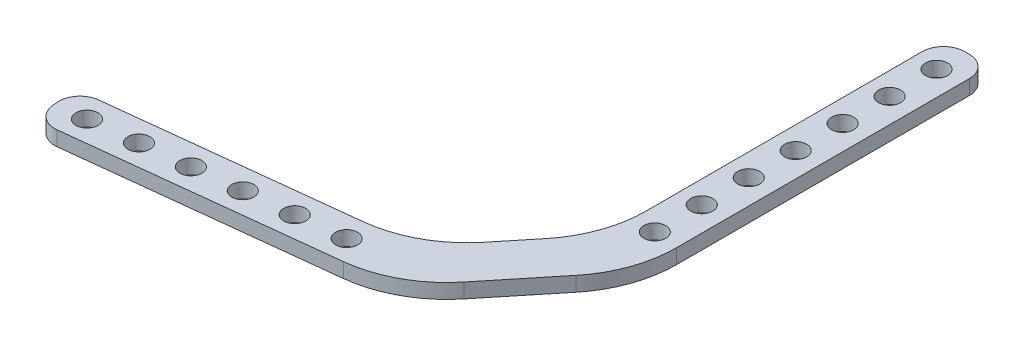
ISO-10303-21;
HEADER;
FILE_DESCRIPTION(('STEP AP214'),'2;1');
FILE_NAME('part.step','',(''),(''),'','','');
FILE_SCHEMA(('AUTOMOTIVE_DESIGN { 1 0 10303 214 1 1 1 1 }'));
ENDSEC;
DATA;
#1=APPLICATION_CONTEXT('core data for automotive mechanical design processes');
#2=APPLICATION_PROTOCOL_DEFINITION('international standard','automotive_design',2000,#1);
#3=PRODUCT_CONTEXT('',#1,'mechanical');
#4=PRODUCT('Part','Part','',(#3));
#5=PRODUCT_RELATED_PRODUCT_CATEGORY('part','',(#4));
#6=PRODUCT_DEFINITION_FORMATION('','',#4);
#7=PRODUCT_DEFINITION_CONTEXT('part definition',#1,'design');
#8=PRODUCT_DEFINITION('design','',#6,#7);
#9=PRODUCT_DEFINITION_SHAPE('','',#8);
#10=(LENGTH_UNIT() NAMED_UNIT(*) SI_UNIT(.MILLI.,.METRE.));
#11=(NAMED_UNIT(*) PLANE_ANGLE_UNIT() SI_UNIT($,.RADIAN.));
#12=(NAMED_UNIT(*) SI_UNIT($,.STERADIAN.) SOLID_ANGLE_UNIT());
#13=UNCERTAINTY_MEASURE_WITH_UNIT(LENGTH_MEASURE(1.E-05),#10,'distance_accuracy_value','');
#14=(GEOMETRIC_REPRESENTATION_CONTEXT(3) GLOBAL_UNCERTAINTY_ASSIGNED_CONTEXT((#13)) GLOBAL_UNIT_ASSIGNED_CONTEXT((#10,
#11,#12)) REPRESENTATION_CONTEXT('',''));
#15=CARTESIAN_POINT('',(0.,0.,0.));
#16=DIRECTION('',(0.,0.,1.));
#17=DIRECTION('',(1.,0.,0.));
#18=AXIS2_PLACEMENT_3D('',#15,#16,#17);
#19=CARTESIAN_POINT('',(-4.572,3.175,-72.37519815));
#20=DIRECTION('',(0.,1.,0.));
#21=DIRECTION('',(0.,0.,1.));
#22=AXIS2_PLACEMENT_3D('',#19,#20,#21);
#23=PLANE('',#22);
#24=CARTESIAN_POINT('',(-37.4021505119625,3.175,24.9485150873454));
#25=DIRECTION('',(0.,1.,0.));
#26=DIRECTION('',(0.,0.,1.));
#27=AXIS2_PLACEMENT_3D('',#24,#25,#26);
#28=CIRCLE('',#27,2.38125000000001);
#29=CARTESIAN_POINT('',(-37.4021505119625,3.175,27.3297650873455));
#30=VERTEX_POINT('',#29);
#31=EDGE_CURVE('E497',#30,#30,#28,.T.);
#32=ORIENTED_EDGE('',*,*,#31,.F.);
#33=EDGE_LOOP('',(#32));
#34=FACE_BOUND('',#33,.T.);
#35=CARTESIAN_POINT('',(-5.31034936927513,3.175,-29.95719815));
#36=DIRECTION('',(0.,1.,0.));
#37=DIRECTION('',(0.,0.,1.));
#38=AXIS2_PLACEMENT_3D('',#35,#36,#37);
#39=CIRCLE('',#38,2.38125);
#40=CARTESIAN_POINT('',(-5.31034936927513,3.175,-27.57594815));
#41=VERTEX_POINT('',#40);
#42=EDGE_CURVE('E505',#41,#41,#39,.T.);
#43=ORIENTED_EDGE('',*,*,#42,.F.);
#44=EDGE_LOOP('',(#43));
#45=FACE_BOUND('',#44,.T.);
#46=CARTESIAN_POINT('',(-5.31034936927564,3.175,-50.27719815));
#47=DIRECTION('',(0.,1.,0.));
#48=DIRECTION('',(0.,0.,1.));
#49=AXIS2_PLACEMENT_3D('',#46,#47,#48);
#50=CIRCLE('',#49,2.38125);
#51=CARTESIAN_POINT('',(-5.31034936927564,3.175,-47.89594815));
#52=VERTEX_POINT('',#51);
#53=EDGE_CURVE('E513',#52,#52,#50,.T.);
#54=ORIENTED_EDGE('',*,*,#53,.F.);
#55=EDGE_LOOP('',(#54));
#56=FACE_BOUND('',#55,.T.);
#57=CARTESIAN_POINT('',(-5.31034936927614,3.175,-70.59719815));
#58=DIRECTION('',(0.,1.,0.));
#59=DIRECTION('',(0.,0.,1.));
#60=AXIS2_PLACEMENT_3D('',#57,#58,#59);
#61=CIRCLE('',#60,2.38125);
#62=CARTESIAN_POINT('',(-5.31034936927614,3.175,-68.21594815));
#63=VERTEX_POINT('',#62);
#64=EDGE_CURVE('E521',#63,#63,#61,.T.);
#65=ORIENTED_EDGE('',*,*,#64,.F.);
#66=EDGE_LOOP('',(#65));
#67=FACE_BOUND('',#66,.T.);
#68=CARTESIAN_POINT('',(-57.593928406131,3.175,27.2276608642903));
#69=DIRECTION('',(0.,1.,0.));
#70=DIRECTION('',(0.,0.,1.));
#71=AXIS2_PLACEMENT_3D('',#68,#69,#70);
#72=CIRCLE('',#71,2.38124999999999);
#73=CARTESIAN_POINT('',(-57.593928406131,3.175,29.6089108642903));
#74=VERTEX_POINT('',#73);
#75=EDGE_CURVE('E529',#74,#74,#72,.T.);
#76=ORIENTED_EDGE('',*,*,#75,.F.);
#77=EDGE_LOOP('',(#76));
#78=FACE_BOUND('',#77,.T.);
#79=CARTESIAN_POINT('',(-77.7857063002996,3.175,29.5068066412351));
#80=DIRECTION('',(0.,1.,0.));
#81=DIRECTION('',(0.,0.,1.));
#82=AXIS2_PLACEMENT_3D('',#79,#80,#81);
#83=CIRCLE('',#82,2.38125000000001);
#84=CARTESIAN_POINT('',(-77.7857063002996,3.175,31.8880566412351));
#85=VERTEX_POINT('',#84);
#86=EDGE_CURVE('E431',#85,#85,#83,.T.);
#87=ORIENTED_EDGE('',*,*,#86,.F.);
#88=EDGE_LOOP('',(#87));
#89=FACE_BOUND('',#88,.T.);
#90=DIRECTION('',(0.630592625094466,0.,-0.776114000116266));
#91=VECTOR('',#90,1.);
#92=CARTESIAN_POINT('',(-23.114,3.175,28.448));
#93=LINE('',#92,#91);
#94=CARTESIAN_POINT('',(-16.5667748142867,3.175,20.3898766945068));
#95=VERTEX_POINT('',#94);
#96=CARTESIAN_POINT('',(-5.68670439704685,3.175,6.99902079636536));
#97=VERTEX_POINT('',#96);
#98=EDGE_CURVE('E159',#95,#97,#93,.T.);
#99=ORIENTED_EDGE('',*,*,#98,.T.);
#100=CARTESIAN_POINT('',(-25.4,3.175,-9.01803188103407));
#101=DIRECTION('',(0.,1.,0.));
#102=DIRECTION('',(0.,0.,1.));
#103=AXIS2_PLACEMENT_3D('',#100,#101,#102);
#104=CIRCLE('',#103,25.4);
#105=CARTESIAN_POINT('',(0.,3.175,-9.01803188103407));
#106=VERTEX_POINT('',#105);
#107=EDGE_CURVE('E155',#97,#106,#104,.T.);
#108=ORIENTED_EDGE('',*,*,#107,.T.);
#109=DIRECTION('',(0.,0.,-1.));
#110=VECTOR('',#109,1.);
#111=CARTESIAN_POINT('',(0.,3.175,0.));
#112=LINE('',#111,#110);
#113=CARTESIAN_POINT('',(0.,3.175,-72.37519815));
#114=VERTEX_POINT('',#113);
#115=EDGE_CURVE('E148',#106,#114,#112,.T.);
#116=ORIENTED_EDGE('',*,*,#115,.T.);
#117=CARTESIAN_POINT('',(-4.572,3.175,-72.37519815));
#118=DIRECTION('',(0.,1.,0.));
#119=DIRECTION('',(0.,0.,1.));
#120=AXIS2_PLACEMENT_3D('',#117,#118,#119);
#121=CIRCLE('',#120,4.572);
#122=CARTESIAN_POINT('',(-4.572,3.175,-76.94719815));
#123=VERTEX_POINT('',#122);
#124=EDGE_CURVE('E152',#114,#123,#121,.T.);
#125=ORIENTED_EDGE('',*,*,#124,.T.);
#126=DIRECTION('',(-1.,0.,0.));
#127=VECTOR('',#126,1.);
#128=CARTESIAN_POINT('',(-4.572,3.175,-76.94719815));
#129=LINE('',#128,#127);
#130=CARTESIAN_POINT('',(-5.588,3.175,-76.94719815));
#131=VERTEX_POINT('',#130);
#132=EDGE_CURVE('E174',#123,#131,#129,.T.);
#133=ORIENTED_EDGE('',*,*,#132,.T.);
#134=CARTESIAN_POINT('',(-5.588,3.175,-72.37519815));
#135=DIRECTION('',(0.,1.,0.));
#136=DIRECTION('',(0.,0.,1.));
#137=AXIS2_PLACEMENT_3D('',#134,#135,#136);
#138=CIRCLE('',#137,4.572);
#139=CARTESIAN_POINT('',(-10.16,3.175,-72.37519815));
#140=VERTEX_POINT('',#139);
#141=EDGE_CURVE('E176',#131,#140,#138,.T.);
#142=ORIENTED_EDGE('',*,*,#141,.T.);
#143=DIRECTION('',(0.,0.,1.));
#144=VECTOR('',#143,1.);
#145=CARTESIAN_POINT('',(-10.16,3.175,-72.37519815));
#146=LINE('',#145,#144);
#147=CARTESIAN_POINT('',(-10.16,3.175,-12.6252446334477));
#148=VERTEX_POINT('',#147);
#149=EDGE_CURVE('E181',#140,#148,#146,.T.);
#150=ORIENTED_EDGE('',*,*,#149,.T.);
#151=CARTESIAN_POINT('',(-35.56,3.175,-12.6252446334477));
#152=DIRECTION('',(0.,1.,0.));
#153=DIRECTION('',(0.,0.,1.));
#154=AXIS2_PLACEMENT_3D('',#151,#152,#153);
#155=CIRCLE('',#154,25.4);
#156=CARTESIAN_POINT('',(-15.8467043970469,3.175,3.39180804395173));
#157=VERTEX_POINT('',#156);
#158=EDGE_CURVE('E267',#148,#157,#155,.F.);
#159=ORIENTED_EDGE('',*,*,#158,.T.);
#160=DIRECTION('',(-0.630592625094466,0.,0.776114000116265));
#161=VECTOR('',#160,1.);
#162=CARTESIAN_POINT('',(-10.16,3.175,-3.60721275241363));
#163=LINE('',#162,#161);
#164=CARTESIAN_POINT('',(-21.8332029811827,3.175,10.7598063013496));
#165=VERTEX_POINT('',#164);
#166=EDGE_CURVE('E184',#157,#165,#163,.T.);
#167=ORIENTED_EDGE('',*,*,#166,.T.);
#168=CARTESIAN_POINT('',(-41.5464985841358,3.175,-5.2572463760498));
#169=DIRECTION('',(0.,1.,0.));
#170=DIRECTION('',(0.,0.,1.));
#171=AXIS2_PLACEMENT_3D('',#168,#169,#170);
#172=CIRCLE('',#171,25.4);
#173=CARTESIAN_POINT('',(-38.6975663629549,3.175,19.9824759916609));
#174=VERTEX_POINT('',#173);
#175=EDGE_CURVE('E11',#165,#174,#172,.F.);
#176=ORIENTED_EDGE('',*,*,#175,.T.);
#177=DIRECTION('',(-0.993689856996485,0.,0.112162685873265));
#178=VECTOR('',#177,1.);
#179=CARTESIAN_POINT('',(-28.3804281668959,3.175,18.8179296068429));
#180=LINE('',#179,#178);
#181=CARTESIAN_POINT('',(-90.2181622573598,3.175,25.797860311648));
#182=VERTEX_POINT('',#181);
#183=EDGE_CURVE('E187',#174,#182,#180,.T.);
#184=ORIENTED_EDGE('',*,*,#183,.T.);
#185=CARTESIAN_POINT('',(-89.7053544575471,3.175,30.3410103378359));
#186=DIRECTION('',(0.,1.,0.));
#187=DIRECTION('',(0.,0.,1.));
#188=AXIS2_PLACEMENT_3D('',#185,#186,#187);
#189=CIRCLE('',#188,4.57200000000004);
#190=CARTESIAN_POINT('',(-94.2485044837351,3.175,30.8538181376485));
#191=VERTEX_POINT('',#190);
#192=EDGE_CURVE('E189',#182,#191,#189,.T.);
#193=ORIENTED_EDGE('',*,*,#192,.T.);
#194=DIRECTION('',(0.112162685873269,0.,0.993689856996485));
#195=VECTOR('',#194,1.);
#196=CARTESIAN_POINT('',(-94.2485044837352,3.175,30.8538181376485));
#197=LINE('',#196,#195);
#198=CARTESIAN_POINT('',(-94.1345471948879,3.175,31.863407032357));
#199=VERTEX_POINT('',#198);
#200=EDGE_CURVE('E191',#191,#199,#197,.T.);
#201=ORIENTED_EDGE('',*,*,#200,.T.);
#202=CARTESIAN_POINT('',(-89.5913971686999,3.175,31.3505992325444));
#203=DIRECTION('',(0.,1.,0.));
#204=DIRECTION('',(0.,0.,1.));
#205=AXIS2_PLACEMENT_3D('',#202,#203,#204);
#206=CIRCLE('',#205,4.57200000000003);
#207=CARTESIAN_POINT('',(-89.0785893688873,3.175,35.8937492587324));
#208=VERTEX_POINT('',#207);
#209=EDGE_CURVE('E193',#199,#208,#206,.T.);
#210=ORIENTED_EDGE('',*,*,#209,.T.);
#211=DIRECTION('',(0.993689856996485,0.,-0.112162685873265));
#212=VECTOR('',#211,1.);
#213=CARTESIAN_POINT('',(-89.0785893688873,3.175,35.8937492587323));
#214=LINE('',#213,#212);
#215=CARTESIAN_POINT('',(-33.431138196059,3.175,29.6125463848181));
#216=VERTEX_POINT('',#215);
#217=EDGE_CURVE('E195',#208,#216,#214,.T.);
#218=ORIENTED_EDGE('',*,*,#217,.T.);
#219=CARTESIAN_POINT('',(-36.2800704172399,3.175,4.37282401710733));
#220=DIRECTION('',(0.,1.,0.));
#221=DIRECTION('',(0.,0.,1.));
#222=AXIS2_PLACEMENT_3D('',#219,#220,#221);
#223=CIRCLE('',#222,25.4);
#224=EDGE_CURVE('E261',#216,#95,#223,.T.);
#225=ORIENTED_EDGE('',*,*,#224,.T.);
#226=EDGE_LOOP('',(#99,#108,#116,#125,#133,#142,#150,#159,#167,#176,#184,#193,#201,#210,#218,#225));
#227=FACE_BOUND('',#226,.T.);
#228=CARTESIAN_POINT('',(-87.8815952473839,3.175,30.6463795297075));
#229=DIRECTION('',(0.,1.,0.));
#230=DIRECTION('',(0.,0.,1.));
#231=AXIS2_PLACEMENT_3D('',#228,#229,#230);
#232=CIRCLE('',#231,2.38124999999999);
#233=CARTESIAN_POINT('',(-87.8815952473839,3.175,33.0276295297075));
#234=VERTEX_POINT('',#233);
#235=EDGE_CURVE('E200',#234,#234,#232,.T.);
#236=ORIENTED_EDGE('',*,*,#235,.F.);
#237=EDGE_LOOP('',(#236));
#238=FACE_BOUND('',#237,.T.);
#239=CARTESIAN_POINT('',(-67.6898173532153,3.175,28.3672337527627));
#240=DIRECTION('',(0.,1.,0.));
#241=DIRECTION('',(0.,0.,1.));
#242=AXIS2_PLACEMENT_3D('',#239,#240,#241);
#243=CIRCLE('',#242,2.38124999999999);
#244=CARTESIAN_POINT('',(-67.6898173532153,3.175,30.7484837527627));
#245=VERTEX_POINT('',#244);
#246=EDGE_CURVE('E436',#245,#245,#243,.T.);
#247=ORIENTED_EDGE('',*,*,#246,.F.);
#248=EDGE_LOOP('',(#247));
#249=FACE_BOUND('',#248,.T.);
#250=CARTESIAN_POINT('',(-47.4980394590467,3.175,26.0880879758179));
#251=DIRECTION('',(0.,1.,0.));
#252=DIRECTION('',(0.,0.,1.));
#253=AXIS2_PLACEMENT_3D('',#250,#251,#252);
#254=CIRCLE('',#253,2.38125);
#255=CARTESIAN_POINT('',(-47.4980394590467,3.175,28.4693379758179));
#256=VERTEX_POINT('',#255);
#257=EDGE_CURVE('E525',#256,#256,#254,.T.);
#258=ORIENTED_EDGE('',*,*,#257,.F.);
#259=EDGE_LOOP('',(#258));
#260=FACE_BOUND('',#259,.T.);
#261=CARTESIAN_POINT('',(-5.31034936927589,3.175,-60.43719815));
#262=DIRECTION('',(0.,1.,0.));
#263=DIRECTION('',(0.,0.,1.));
#264=AXIS2_PLACEMENT_3D('',#261,#262,#263);
#265=CIRCLE('',#264,2.38125);
#266=CARTESIAN_POINT('',(-5.31034936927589,3.175,-58.05594815));
#267=VERTEX_POINT('',#266);
#268=EDGE_CURVE('E517',#267,#267,#265,.T.);
#269=ORIENTED_EDGE('',*,*,#268,.F.);
#270=EDGE_LOOP('',(#269));
#271=FACE_BOUND('',#270,.T.);
#272=CARTESIAN_POINT('',(-5.31034936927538,3.175,-40.11719815));
#273=DIRECTION('',(0.,1.,0.));
#274=DIRECTION('',(0.,0.,1.));
#275=AXIS2_PLACEMENT_3D('',#272,#273,#274);
#276=CIRCLE('',#275,2.38125);
#277=CARTESIAN_POINT('',(-5.31034936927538,3.175,-37.73594815));
#278=VERTEX_POINT('',#277);
#279=EDGE_CURVE('E509',#278,#278,#276,.T.);
#280=ORIENTED_EDGE('',*,*,#279,.F.);
#281=EDGE_LOOP('',(#280));
#282=FACE_BOUND('',#281,.T.);
#283=CARTESIAN_POINT('',(-5.31034936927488,3.175,-19.79719815));
#284=DIRECTION('',(0.,1.,0.));
#285=DIRECTION('',(0.,0.,1.));
#286=AXIS2_PLACEMENT_3D('',#283,#284,#285);
#287=CIRCLE('',#286,2.38125);
#288=CARTESIAN_POINT('',(-5.31034936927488,3.175,-17.41594815));
#289=VERTEX_POINT('',#288);
#290=EDGE_CURVE('E501',#289,#289,#287,.T.);
#291=ORIENTED_EDGE('',*,*,#290,.F.);
#292=EDGE_LOOP('',(#291));
#293=FACE_BOUND('',#292,.T.);
#294=CARTESIAN_POINT('',(-5.31034936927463,3.175,-9.63719815));
#295=DIRECTION('',(0.,1.,0.));
#296=DIRECTION('',(0.,0.,1.));
#297=AXIS2_PLACEMENT_3D('',#294,#295,#296);
#298=CIRCLE('',#297,2.38125);
#299=CARTESIAN_POINT('',(-5.31034936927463,3.175,-7.25594815));
#300=VERTEX_POINT('',#299);
#301=EDGE_CURVE('E493',#300,#300,#298,.T.);
#302=ORIENTED_EDGE('',*,*,#301,.F.);
#303=EDGE_LOOP('',(#302));
#304=FACE_BOUND('',#303,.T.);
#305=ADVANCED_FACE('F33',(#34,#45,#56,#67,#78,#89,#227,#238,#249,#260,#271,#282,#293,#304),#23,.T.);
#306=CARTESIAN_POINT('',(-4.572,0.,-72.37519815));
#307=DIRECTION('',(0.,1.,0.));
#308=DIRECTION('',(0.,0.,1.));
#309=AXIS2_PLACEMENT_3D('',#306,#307,#308);
#310=PLANE('',#309);
#311=DIRECTION('',(0.,0.,-1.));
#312=VECTOR('',#311,1.);
#313=CARTESIAN_POINT('',(0.,0.,0.));
#314=LINE('',#313,#312);
#315=CARTESIAN_POINT('',(0.,0.,-9.01803188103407));
#316=VERTEX_POINT('',#315);
#317=CARTESIAN_POINT('',(0.,0.,-72.37519815));
#318=VERTEX_POINT('',#317);
#319=EDGE_CURVE('E165',#316,#318,#314,.T.);
#320=ORIENTED_EDGE('',*,*,#319,.F.);
#321=CARTESIAN_POINT('',(-25.4,0.,-9.01803188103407));
#322=DIRECTION('',(0.,1.,0.));
#323=DIRECTION('',(0.,0.,1.));
#324=AXIS2_PLACEMENT_3D('',#321,#322,#323);
#325=CIRCLE('',#324,25.4);
#326=CARTESIAN_POINT('',(-5.68670439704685,0.,6.99902079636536));
#327=VERTEX_POINT('',#326);
#328=EDGE_CURVE('E255',#316,#327,#325,.F.);
#329=ORIENTED_EDGE('',*,*,#328,.T.);
#330=DIRECTION('',(0.630592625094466,0.,-0.776114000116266));
#331=VECTOR('',#330,1.);
#332=CARTESIAN_POINT('',(-23.114,0.,28.448));
#333=LINE('',#332,#331);
#334=CARTESIAN_POINT('',(-16.5667748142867,0.,20.3898766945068));
#335=VERTEX_POINT('',#334);
#336=EDGE_CURVE('E198',#335,#327,#333,.T.);
#337=ORIENTED_EDGE('',*,*,#336,.F.);
#338=CARTESIAN_POINT('',(-36.2800704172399,0.,4.37282401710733));
#339=DIRECTION('',(0.,1.,0.));
#340=DIRECTION('',(0.,0.,1.));
#341=AXIS2_PLACEMENT_3D('',#338,#339,#340);
#342=CIRCLE('',#341,25.4);
#343=CARTESIAN_POINT('',(-33.431138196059,0.,29.6125463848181));
#344=VERTEX_POINT('',#343);
#345=EDGE_CURVE('E253',#335,#344,#342,.F.);
#346=ORIENTED_EDGE('',*,*,#345,.T.);
#347=DIRECTION('',(0.993689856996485,0.,-0.112162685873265));
#348=VECTOR('',#347,1.);
#349=CARTESIAN_POINT('',(-89.0785893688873,0.,35.8937492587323));
#350=LINE('',#349,#348);
#351=CARTESIAN_POINT('',(-89.0785893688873,0.,35.8937492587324));
#352=VERTEX_POINT('',#351);
#353=EDGE_CURVE('E222',#352,#344,#350,.T.);
#354=ORIENTED_EDGE('',*,*,#353,.F.);
#355=CARTESIAN_POINT('',(-89.5913971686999,0.,31.3505992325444));
#356=DIRECTION('',(0.,1.,0.));
#357=DIRECTION('',(0.,0.,1.));
#358=AXIS2_PLACEMENT_3D('',#355,#356,#357);
#359=CIRCLE('',#358,4.57200000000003);
#360=CARTESIAN_POINT('',(-94.1345471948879,0.,31.863407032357));
#361=VERTEX_POINT('',#360);
#362=EDGE_CURVE('E220',#361,#352,#359,.T.);
#363=ORIENTED_EDGE('',*,*,#362,.F.);
#364=DIRECTION('',(0.112162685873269,0.,0.993689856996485));
#365=VECTOR('',#364,1.);
#366=CARTESIAN_POINT('',(-94.2485044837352,0.,30.8538181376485));
#367=LINE('',#366,#365);
#368=CARTESIAN_POINT('',(-94.2485044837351,0.,30.8538181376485));
#369=VERTEX_POINT('',#368);
#370=EDGE_CURVE('E218',#369,#361,#367,.T.);
#371=ORIENTED_EDGE('',*,*,#370,.F.);
#372=CARTESIAN_POINT('',(-89.7053544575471,0.,30.3410103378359));
#373=DIRECTION('',(0.,1.,0.));
#374=DIRECTION('',(0.,0.,1.));
#375=AXIS2_PLACEMENT_3D('',#372,#373,#374);
#376=CIRCLE('',#375,4.57200000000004);
#377=CARTESIAN_POINT('',(-90.2181622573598,0.,25.797860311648));
#378=VERTEX_POINT('',#377);
#379=EDGE_CURVE('E216',#378,#369,#376,.T.);
#380=ORIENTED_EDGE('',*,*,#379,.F.);
#381=DIRECTION('',(-0.993689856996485,0.,0.112162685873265));
#382=VECTOR('',#381,1.);
#383=CARTESIAN_POINT('',(-28.3804281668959,0.,18.8179296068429));
#384=LINE('',#383,#382);
#385=CARTESIAN_POINT('',(-38.6975663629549,0.,19.9824759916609));
#386=VERTEX_POINT('',#385);
#387=EDGE_CURVE('E214',#386,#378,#384,.T.);
#388=ORIENTED_EDGE('',*,*,#387,.F.);
#389=CARTESIAN_POINT('',(-41.5464985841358,0.,-5.2572463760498));
#390=DIRECTION('',(0.,1.,0.));
#391=DIRECTION('',(0.,0.,1.));
#392=AXIS2_PLACEMENT_3D('',#389,#390,#391);
#393=CIRCLE('',#392,25.4);
#394=CARTESIAN_POINT('',(-21.8332029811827,0.,10.7598063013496));
#395=VERTEX_POINT('',#394);
#396=EDGE_CURVE('E41',#386,#395,#393,.T.);
#397=ORIENTED_EDGE('',*,*,#396,.T.);
#398=DIRECTION('',(-0.630592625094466,0.,0.776114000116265));
#399=VECTOR('',#398,1.);
#400=CARTESIAN_POINT('',(-10.16,0.,-3.60721275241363));
#401=LINE('',#400,#399);
#402=CARTESIAN_POINT('',(-15.8467043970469,0.,3.39180804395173));
#403=VERTEX_POINT('',#402);
#404=EDGE_CURVE('E211',#403,#395,#401,.T.);
#405=ORIENTED_EDGE('',*,*,#404,.F.);
#406=CARTESIAN_POINT('',(-35.56,0.,-12.6252446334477));
#407=DIRECTION('',(0.,1.,0.));
#408=DIRECTION('',(0.,0.,1.));
#409=AXIS2_PLACEMENT_3D('',#406,#407,#408);
#410=CIRCLE('',#409,25.4);
#411=CARTESIAN_POINT('',(-10.16,0.,-12.6252446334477));
#412=VERTEX_POINT('',#411);
#413=EDGE_CURVE('E265',#403,#412,#410,.T.);
#414=ORIENTED_EDGE('',*,*,#413,.T.);
#415=DIRECTION('',(0.,0.,1.));
#416=VECTOR('',#415,1.);
#417=CARTESIAN_POINT('',(-10.16,0.,-72.37519815));
#418=LINE('',#417,#416);
#419=CARTESIAN_POINT('',(-10.16,0.,-72.37519815));
#420=VERTEX_POINT('',#419);
#421=EDGE_CURVE('E208',#420,#412,#418,.T.);
#422=ORIENTED_EDGE('',*,*,#421,.F.);
#423=CARTESIAN_POINT('',(-5.588,0.,-72.37519815));
#424=DIRECTION('',(0.,1.,0.));
#425=DIRECTION('',(0.,0.,1.));
#426=AXIS2_PLACEMENT_3D('',#423,#424,#425);
#427=CIRCLE('',#426,4.572);
#428=CARTESIAN_POINT('',(-5.588,0.,-76.94719815));
#429=VERTEX_POINT('',#428);
#430=EDGE_CURVE('E206',#429,#420,#427,.T.);
#431=ORIENTED_EDGE('',*,*,#430,.F.);
#432=DIRECTION('',(-1.,0.,0.));
#433=VECTOR('',#432,1.);
#434=CARTESIAN_POINT('',(-4.572,0.,-76.94719815));
#435=LINE('',#434,#433);
#436=CARTESIAN_POINT('',(-4.572,0.,-76.94719815));
#437=VERTEX_POINT('',#436);
#438=EDGE_CURVE('E204',#437,#429,#435,.T.);
#439=ORIENTED_EDGE('',*,*,#438,.F.);
#440=CARTESIAN_POINT('',(-4.572,0.,-72.37519815));
#441=DIRECTION('',(0.,1.,0.));
#442=DIRECTION('',(0.,0.,1.));
#443=AXIS2_PLACEMENT_3D('',#440,#441,#442);
#444=CIRCLE('',#443,4.572);
#445=EDGE_CURVE('E202',#318,#437,#444,.T.);
#446=ORIENTED_EDGE('',*,*,#445,.F.);
#447=EDGE_LOOP('',(#320,#329,#337,#346,#354,#363,#371,#380,#388,#397,#405,#414,#422,#431,#439,#446));
#448=FACE_BOUND('',#447,.T.);
#449=CARTESIAN_POINT('',(-87.8815952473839,0.,30.6463795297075));
#450=DIRECTION('',(0.,1.,0.));
#451=DIRECTION('',(0.,0.,1.));
#452=AXIS2_PLACEMENT_3D('',#449,#450,#451);
#453=CIRCLE('',#452,2.38124999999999);
#454=CARTESIAN_POINT('',(-87.8815952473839,0.,33.0276295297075));
#455=VERTEX_POINT('',#454);
#456=EDGE_CURVE('E438',#455,#455,#453,.T.);
#457=ORIENTED_EDGE('',*,*,#456,.T.);
#458=EDGE_LOOP('',(#457));
#459=FACE_BOUND('',#458,.T.);
#460=CARTESIAN_POINT('',(-77.7857063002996,0.,29.5068066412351));
#461=DIRECTION('',(0.,1.,0.));
#462=DIRECTION('',(0.,0.,1.));
#463=AXIS2_PLACEMENT_3D('',#460,#461,#462);
#464=CIRCLE('',#463,2.38125000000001);
#465=CARTESIAN_POINT('',(-77.7857063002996,0.,31.8880566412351));
#466=VERTEX_POINT('',#465);
#467=EDGE_CURVE('E434',#466,#466,#464,.T.);
#468=ORIENTED_EDGE('',*,*,#467,.T.);
#469=EDGE_LOOP('',(#468));
#470=FACE_BOUND('',#469,.T.);
#471=CARTESIAN_POINT('',(-67.6898173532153,0.,28.3672337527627));
#472=DIRECTION('',(0.,1.,0.));
#473=DIRECTION('',(0.,0.,1.));
#474=AXIS2_PLACEMENT_3D('',#471,#472,#473);
#475=CIRCLE('',#474,2.38124999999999);
#476=CARTESIAN_POINT('',(-67.6898173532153,0.,30.7484837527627));
#477=VERTEX_POINT('',#476);
#478=EDGE_CURVE('E441',#477,#477,#475,.T.);
#479=ORIENTED_EDGE('',*,*,#478,.T.);
#480=EDGE_LOOP('',(#479));
#481=FACE_BOUND('',#480,.T.);
#482=CARTESIAN_POINT('',(-57.593928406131,0.,27.2276608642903));
#483=DIRECTION('',(0.,1.,0.));
#484=DIRECTION('',(0.,0.,1.));
#485=AXIS2_PLACEMENT_3D('',#482,#483,#484);
#486=CIRCLE('',#485,2.38124999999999);
#487=CARTESIAN_POINT('',(-57.593928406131,0.,29.6089108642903));
#488=VERTEX_POINT('',#487);
#489=EDGE_CURVE('E457',#488,#488,#486,.T.);
#490=ORIENTED_EDGE('',*,*,#489,.T.);
#491=EDGE_LOOP('',(#490));
#492=FACE_BOUND('',#491,.T.);
#493=CARTESIAN_POINT('',(-47.4980394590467,0.,26.0880879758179));
#494=DIRECTION('',(0.,1.,0.));
#495=DIRECTION('',(0.,0.,1.));
#496=AXIS2_PLACEMENT_3D('',#493,#494,#495);
#497=CIRCLE('',#496,2.38125);
#498=CARTESIAN_POINT('',(-47.4980394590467,0.,28.4693379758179));
#499=VERTEX_POINT('',#498);
#500=EDGE_CURVE('E461',#499,#499,#497,.T.);
#501=ORIENTED_EDGE('',*,*,#500,.T.);
#502=EDGE_LOOP('',(#501));
#503=FACE_BOUND('',#502,.T.);
#504=CARTESIAN_POINT('',(-5.31034936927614,0.,-70.59719815));
#505=DIRECTION('',(0.,1.,0.));
#506=DIRECTION('',(0.,0.,1.));
#507=AXIS2_PLACEMENT_3D('',#504,#505,#506);
#508=CIRCLE('',#507,2.38125);
#509=CARTESIAN_POINT('',(-5.31034936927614,0.,-68.21594815));
#510=VERTEX_POINT('',#509);
#511=EDGE_CURVE('E465',#510,#510,#508,.T.);
#512=ORIENTED_EDGE('',*,*,#511,.T.);
#513=EDGE_LOOP('',(#512));
#514=FACE_BOUND('',#513,.T.);
#515=CARTESIAN_POINT('',(-5.31034936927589,0.,-60.43719815));
#516=DIRECTION('',(0.,1.,0.));
#517=DIRECTION('',(0.,0.,1.));
#518=AXIS2_PLACEMENT_3D('',#515,#516,#517);
#519=CIRCLE('',#518,2.38125);
#520=CARTESIAN_POINT('',(-5.31034936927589,0.,-58.05594815));
#521=VERTEX_POINT('',#520);
#522=EDGE_CURVE('E469',#521,#521,#519,.T.);
#523=ORIENTED_EDGE('',*,*,#522,.T.);
#524=EDGE_LOOP('',(#523));
#525=FACE_BOUND('',#524,.T.);
#526=CARTESIAN_POINT('',(-5.31034936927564,0.,-50.27719815));
#527=DIRECTION('',(0.,1.,0.));
#528=DIRECTION('',(0.,0.,1.));
#529=AXIS2_PLACEMENT_3D('',#526,#527,#528);
#530=CIRCLE('',#529,2.38125);
#531=CARTESIAN_POINT('',(-5.31034936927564,0.,-47.89594815));
#532=VERTEX_POINT('',#531);
#533=EDGE_CURVE('E473',#532,#532,#530,.T.);
#534=ORIENTED_EDGE('',*,*,#533,.T.);
#535=EDGE_LOOP('',(#534));
#536=FACE_BOUND('',#535,.T.);
#537=CARTESIAN_POINT('',(-5.31034936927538,0.,-40.11719815));
#538=DIRECTION('',(0.,1.,0.));
#539=DIRECTION('',(0.,0.,1.));
#540=AXIS2_PLACEMENT_3D('',#537,#538,#539);
#541=CIRCLE('',#540,2.38125);
#542=CARTESIAN_POINT('',(-5.31034936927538,0.,-37.73594815));
#543=VERTEX_POINT('',#542);
#544=EDGE_CURVE('E477',#543,#543,#541,.T.);
#545=ORIENTED_EDGE('',*,*,#544,.T.);
#546=EDGE_LOOP('',(#545));
#547=FACE_BOUND('',#546,.T.);
#548=CARTESIAN_POINT('',(-5.31034936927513,0.,-29.95719815));
#549=DIRECTION('',(0.,1.,0.));
#550=DIRECTION('',(0.,0.,1.));
#551=AXIS2_PLACEMENT_3D('',#548,#549,#550);
#552=CIRCLE('',#551,2.38125);
#553=CARTESIAN_POINT('',(-5.31034936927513,0.,-27.57594815));
#554=VERTEX_POINT('',#553);
#555=EDGE_CURVE('E481',#554,#554,#552,.T.);
#556=ORIENTED_EDGE('',*,*,#555,.T.);
#557=EDGE_LOOP('',(#556));
#558=FACE_BOUND('',#557,.T.);
#559=CARTESIAN_POINT('',(-5.31034936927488,0.,-19.79719815));
#560=DIRECTION('',(0.,1.,0.));
#561=DIRECTION('',(0.,0.,1.));
#562=AXIS2_PLACEMENT_3D('',#559,#560,#561);
#563=CIRCLE('',#562,2.38125);
#564=CARTESIAN_POINT('',(-5.31034936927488,0.,-17.41594815));
#565=VERTEX_POINT('',#564);
#566=EDGE_CURVE('E485',#565,#565,#563,.T.);
#567=ORIENTED_EDGE('',*,*,#566,.T.);
#568=EDGE_LOOP('',(#567));
#569=FACE_BOUND('',#568,.T.);
#570=CARTESIAN_POINT('',(-37.4021505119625,0.,24.9485150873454));
#571=DIRECTION('',(0.,1.,0.));
#572=DIRECTION('',(0.,0.,1.));
#573=AXIS2_PLACEMENT_3D('',#570,#571,#572);
#574=CIRCLE('',#573,2.38125000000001);
#575=CARTESIAN_POINT('',(-37.4021505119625,0.,27.3297650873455));
#576=VERTEX_POINT('',#575);
#577=EDGE_CURVE('E489',#576,#576,#574,.T.);
#578=ORIENTED_EDGE('',*,*,#577,.T.);
#579=EDGE_LOOP('',(#578));
#580=FACE_BOUND('',#579,.T.);
#581=CARTESIAN_POINT('',(-5.31034936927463,0.,-9.63719815));
#582=DIRECTION('',(0.,1.,0.));
#583=DIRECTION('',(0.,0.,1.));
#584=AXIS2_PLACEMENT_3D('',#581,#582,#583);
#585=CIRCLE('',#584,2.38125);
#586=CARTESIAN_POINT('',(-5.31034936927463,0.,-7.25594815));
#587=VERTEX_POINT('',#586);
#588=EDGE_CURVE('E492',#587,#587,#585,.T.);
#589=ORIENTED_EDGE('',*,*,#588,.T.);
#590=EDGE_LOOP('',(#589));
#591=FACE_BOUND('',#590,.T.);
#592=ADVANCED_FACE('F271',(#448,#459,#470,#481,#492,#503,#514,#525,#536,#547,#558,#569,#580,
#591),#310,.F.);
#593=CARTESIAN_POINT('',(-23.114,3.175,28.448));
#594=DIRECTION('',(-0.776114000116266,0.,-0.630592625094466));
#595=DIRECTION('',(-0.630592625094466,0.,0.776114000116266));
#596=AXIS2_PLACEMENT_3D('',#593,#594,#595);
#597=PLANE('',#596);
#598=ORIENTED_EDGE('',*,*,#336,.T.);
#599=DIRECTION('',(0.,-1.,0.));
#600=VECTOR('',#599,1.);
#601=CARTESIAN_POINT('',(-5.68670439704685,3.175,6.99902079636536));
#602=LINE('',#601,#600);
#603=EDGE_CURVE('E56',#327,#97,#602,.F.);
#604=ORIENTED_EDGE('',*,*,#603,.T.);
#605=ORIENTED_EDGE('',*,*,#98,.F.);
#606=DIRECTION('',(0.,-1.,0.));
#607=VECTOR('',#606,1.);
#608=CARTESIAN_POINT('',(-16.5667748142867,3.175,20.3898766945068));
#609=LINE('',#608,#607);
#610=EDGE_CURVE('E257',#95,#335,#609,.T.);
#611=ORIENTED_EDGE('',*,*,#610,.T.);
#612=EDGE_LOOP('',(#598,#604,#605,#611));
#613=FACE_BOUND('',#612,.T.);
#614=ADVANCED_FACE('F307',(#613),#597,.F.);
#615=CARTESIAN_POINT('',(0.,3.175,0.));
#616=DIRECTION('',(-1.,0.,0.));
#617=DIRECTION('',(0.,0.,1.));
#618=AXIS2_PLACEMENT_3D('',#615,#616,#617);
#619=PLANE('',#618);
#620=ORIENTED_EDGE('',*,*,#115,.F.);
#621=DIRECTION('',(0.,-1.,0.));
#622=VECTOR('',#621,1.);
#623=CARTESIAN_POINT('',(0.,3.175,-9.01803188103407));
#624=LINE('',#623,#622);
#625=EDGE_CURVE('E251',#106,#316,#624,.T.);
#626=ORIENTED_EDGE('',*,*,#625,.T.);
#627=ORIENTED_EDGE('',*,*,#319,.T.);
#628=DIRECTION('',(0.,-1.,0.));
#629=VECTOR('',#628,1.);
#630=CARTESIAN_POINT('',(0.,3.175,-72.37519815));
#631=LINE('',#630,#629);
#632=EDGE_CURVE('E162',#114,#318,#631,.T.);
#633=ORIENTED_EDGE('',*,*,#632,.F.);
#634=EDGE_LOOP('',(#620,#626,#627,#633));
#635=FACE_BOUND('',#634,.T.);
#636=ADVANCED_FACE('F163',(#635),#619,.F.);
#637=CARTESIAN_POINT('',(-4.572,3.175,-72.37519815));
#638=DIRECTION('',(0.,-1.,0.));
#639=DIRECTION('',(0.,0.,-1.));
#640=AXIS2_PLACEMENT_3D('',#637,#638,#639);
#641=CYLINDRICAL_SURFACE('',#640,4.572);
#642=ORIENTED_EDGE('',*,*,#445,.T.);
#643=DIRECTION('',(0.,-1.,0.));
#644=VECTOR('',#643,1.);
#645=CARTESIAN_POINT('',(-4.572,3.175,-76.94719815));
#646=LINE('',#645,#644);
#647=EDGE_CURVE('E169',#123,#437,#646,.T.);
#648=ORIENTED_EDGE('',*,*,#647,.F.);
#649=ORIENTED_EDGE('',*,*,#124,.F.);
#650=ORIENTED_EDGE('',*,*,#632,.T.);
#651=EDGE_LOOP('',(#642,#648,#649,#650));
#652=FACE_BOUND('',#651,.T.);
#653=ADVANCED_FACE('F171',(#652),#641,.T.);
#654=CARTESIAN_POINT('',(-4.572,3.175,-76.94719815));
#655=DIRECTION('',(0.,0.,1.));
#656=DIRECTION('',(1.,0.,0.));
#657=AXIS2_PLACEMENT_3D('',#654,#655,#656);
#658=PLANE('',#657);
#659=ORIENTED_EDGE('',*,*,#438,.T.);
#660=DIRECTION('',(0.,-1.,0.));
#661=VECTOR('',#660,1.);
#662=CARTESIAN_POINT('',(-5.588,3.175,-76.94719815));
#663=LINE('',#662,#661);
#664=EDGE_CURVE('E238',#131,#429,#663,.T.);
#665=ORIENTED_EDGE('',*,*,#664,.F.);
#666=ORIENTED_EDGE('',*,*,#132,.F.);
#667=ORIENTED_EDGE('',*,*,#647,.T.);
#668=EDGE_LOOP('',(#659,#665,#666,#667));
#669=FACE_BOUND('',#668,.T.);
#670=ADVANCED_FACE('F349',(#669),#658,.F.);
#671=CARTESIAN_POINT('',(-5.588,3.175,-72.37519815));
#672=DIRECTION('',(0.,-1.,0.));
#673=DIRECTION('',(0.,0.,-1.));
#674=AXIS2_PLACEMENT_3D('',#671,#672,#673);
#675=CYLINDRICAL_SURFACE('',#674,4.572);
#676=ORIENTED_EDGE('',*,*,#430,.T.);
#677=DIRECTION('',(0.,-1.,0.));
#678=VECTOR('',#677,1.);
#679=CARTESIAN_POINT('',(-10.16,3.175,-72.37519815));
#680=LINE('',#679,#678);
#681=EDGE_CURVE('E235',#140,#420,#680,.T.);
#682=ORIENTED_EDGE('',*,*,#681,.F.);
#683=ORIENTED_EDGE('',*,*,#141,.F.);
#684=ORIENTED_EDGE('',*,*,#664,.T.);
#685=EDGE_LOOP('',(#676,#682,#683,#684));
#686=FACE_BOUND('',#685,.T.);
#687=ADVANCED_FACE('F345',(#686),#675,.T.);
#688=CARTESIAN_POINT('',(-10.16,3.175,-72.37519815));
#689=DIRECTION('',(1.,0.,0.));
#690=DIRECTION('',(0.,0.,-1.));
#691=AXIS2_PLACEMENT_3D('',#688,#689,#690);
#692=PLANE('',#691);
#693=ORIENTED_EDGE('',*,*,#421,.T.);
#694=DIRECTION('',(0.,-1.,0.));
#695=VECTOR('',#694,1.);
#696=CARTESIAN_POINT('',(-10.16,3.175,-12.6252446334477));
#697=LINE('',#696,#695);
#698=EDGE_CURVE('E246',#412,#148,#697,.F.);
#699=ORIENTED_EDGE('',*,*,#698,.T.);
#700=ORIENTED_EDGE('',*,*,#149,.F.);
#701=ORIENTED_EDGE('',*,*,#681,.T.);
#702=EDGE_LOOP('',(#693,#699,#700,#701));
#703=FACE_BOUND('',#702,.T.);
#704=ADVANCED_FACE('F342',(#703),#692,.F.);
#705=CARTESIAN_POINT('',(-10.16,3.175,-3.60721275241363));
#706=DIRECTION('',(0.776114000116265,0.,0.630592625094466));
#707=DIRECTION('',(0.630592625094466,0.,-0.776114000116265));
#708=AXIS2_PLACEMENT_3D('',#705,#706,#707);
#709=PLANE('',#708);
#710=ORIENTED_EDGE('',*,*,#166,.F.);
#711=DIRECTION('',(0.,-1.,0.));
#712=VECTOR('',#711,1.);
#713=CARTESIAN_POINT('',(-15.8467043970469,0.,3.39180804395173));
#714=LINE('',#713,#712);
#715=EDGE_CURVE('E243',#157,#403,#714,.T.);
#716=ORIENTED_EDGE('',*,*,#715,.T.);
#717=ORIENTED_EDGE('',*,*,#404,.T.);
#718=DIRECTION('',(0.,-1.,0.));
#719=VECTOR('',#718,1.);
#720=CARTESIAN_POINT('',(-21.8332029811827,3.175,10.7598063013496));
#721=LINE('',#720,#719);
#722=EDGE_CURVE('E168',#395,#165,#721,.F.);
#723=ORIENTED_EDGE('',*,*,#722,.T.);
#724=EDGE_LOOP('',(#710,#716,#717,#723));
#725=FACE_BOUND('',#724,.T.);
#726=ADVANCED_FACE('F279',(#725),#709,.F.);
#727=CARTESIAN_POINT('',(-28.3804281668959,3.175,18.8179296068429));
#728=DIRECTION('',(0.112162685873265,0.,0.993689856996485));
#729=DIRECTION('',(0.993689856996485,0.,-0.112162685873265));
#730=AXIS2_PLACEMENT_3D('',#727,#728,#729);
#731=PLANE('',#730);
#732=ORIENTED_EDGE('',*,*,#183,.F.);
#733=DIRECTION('',(0.,-1.,0.));
#734=VECTOR('',#733,1.);
#735=CARTESIAN_POINT('',(-38.6975663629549,0.,19.9824759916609));
#736=LINE('',#735,#734);
#737=EDGE_CURVE('E248',#174,#386,#736,.T.);
#738=ORIENTED_EDGE('',*,*,#737,.T.);
#739=ORIENTED_EDGE('',*,*,#387,.T.);
#740=DIRECTION('',(0.,-1.,0.));
#741=VECTOR('',#740,1.);
#742=CARTESIAN_POINT('',(-90.2181622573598,3.175,25.797860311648));
#743=LINE('',#742,#741);
#744=EDGE_CURVE('E232',#182,#378,#743,.T.);
#745=ORIENTED_EDGE('',*,*,#744,.F.);
#746=EDGE_LOOP('',(#732,#738,#739,#745));
#747=FACE_BOUND('',#746,.T.);
#748=ADVANCED_FACE('F286',(#747),#731,.F.);
#749=CARTESIAN_POINT('',(-89.7053544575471,3.175,30.3410103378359));
#750=DIRECTION('',(0.,-1.,0.));
#751=DIRECTION('',(0.,0.,-1.));
#752=AXIS2_PLACEMENT_3D('',#749,#750,#751);
#753=CYLINDRICAL_SURFACE('',#752,4.57200000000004);
#754=ORIENTED_EDGE('',*,*,#379,.T.);
#755=DIRECTION('',(0.,-1.,0.));
#756=VECTOR('',#755,1.);
#757=CARTESIAN_POINT('',(-94.2485044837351,3.175,30.8538181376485));
#758=LINE('',#757,#756);
#759=EDGE_CURVE('E229',#191,#369,#758,.T.);
#760=ORIENTED_EDGE('',*,*,#759,.F.);
#761=ORIENTED_EDGE('',*,*,#192,.F.);
#762=ORIENTED_EDGE('',*,*,#744,.T.);
#763=EDGE_LOOP('',(#754,#760,#761,#762));
#764=FACE_BOUND('',#763,.T.);
#765=ADVANCED_FACE('F290',(#764),#753,.T.);
#766=CARTESIAN_POINT('',(-94.2485044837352,3.175,30.8538181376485));
#767=DIRECTION('',(0.993689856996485,0.,-0.112162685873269));
#768=DIRECTION('',(-0.112162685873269,0.,-0.993689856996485));
#769=AXIS2_PLACEMENT_3D('',#766,#767,#768);
#770=PLANE('',#769);
#771=ORIENTED_EDGE('',*,*,#370,.T.);
#772=DIRECTION('',(0.,-1.,0.));
#773=VECTOR('',#772,1.);
#774=CARTESIAN_POINT('',(-94.1345471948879,3.175,31.863407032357));
#775=LINE('',#774,#773);
#776=EDGE_CURVE('E226',#199,#361,#775,.T.);
#777=ORIENTED_EDGE('',*,*,#776,.F.);
#778=ORIENTED_EDGE('',*,*,#200,.F.);
#779=ORIENTED_EDGE('',*,*,#759,.T.);
#780=EDGE_LOOP('',(#771,#777,#778,#779));
#781=FACE_BOUND('',#780,.T.);
#782=ADVANCED_FACE('F296',(#781),#770,.F.);
#783=CARTESIAN_POINT('',(-89.5913971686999,3.175,31.3505992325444));
#784=DIRECTION('',(0.,-1.,0.));
#785=DIRECTION('',(0.,0.,-1.));
#786=AXIS2_PLACEMENT_3D('',#783,#784,#785);
#787=CYLINDRICAL_SURFACE('',#786,4.57200000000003);
#788=ORIENTED_EDGE('',*,*,#362,.T.);
#789=DIRECTION('',(0.,-1.,0.));
#790=VECTOR('',#789,1.);
#791=CARTESIAN_POINT('',(-89.0785893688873,3.175,35.8937492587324));
#792=LINE('',#791,#790);
#793=EDGE_CURVE('E197',#208,#352,#792,.T.);
#794=ORIENTED_EDGE('',*,*,#793,.F.);
#795=ORIENTED_EDGE('',*,*,#209,.F.);
#796=ORIENTED_EDGE('',*,*,#776,.T.);
#797=EDGE_LOOP('',(#788,#794,#795,#796));
#798=FACE_BOUND('',#797,.T.);
#799=ADVANCED_FACE('F300',(#798),#787,.T.);
#800=CARTESIAN_POINT('',(-89.0785893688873,3.175,35.8937492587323));
#801=DIRECTION('',(-0.112162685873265,0.,-0.993689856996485));
#802=DIRECTION('',(-0.993689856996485,0.,0.112162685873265));
#803=AXIS2_PLACEMENT_3D('',#800,#801,#802);
#804=PLANE('',#803);
#805=ORIENTED_EDGE('',*,*,#353,.T.);
#806=DIRECTION('',(0.,-1.,0.));
#807=VECTOR('',#806,1.);
#808=CARTESIAN_POINT('',(-33.431138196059,3.175,29.6125463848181));
#809=LINE('',#808,#807);
#810=EDGE_CURVE('E48',#344,#216,#809,.F.);
#811=ORIENTED_EDGE('',*,*,#810,.T.);
#812=ORIENTED_EDGE('',*,*,#217,.F.);
#813=ORIENTED_EDGE('',*,*,#793,.T.);
#814=EDGE_LOOP('',(#805,#811,#812,#813));
#815=FACE_BOUND('',#814,.T.);
#816=ADVANCED_FACE('F302',(#815),#804,.F.);
#817=CARTESIAN_POINT('',(-87.8815952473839,3.175,30.6463795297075));
#818=DIRECTION('',(0.,-1.,0.));
#819=DIRECTION('',(0.,0.,-1.));
#820=AXIS2_PLACEMENT_3D('',#817,#818,#819);
#821=CYLINDRICAL_SURFACE('',#820,2.38124999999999);
#822=ORIENTED_EDGE('',*,*,#235,.T.);
#823=EDGE_LOOP('',(#822));
#824=FACE_BOUND('',#823,.T.);
#825=ORIENTED_EDGE('',*,*,#456,.F.);
#826=EDGE_LOOP('',(#825));
#827=FACE_BOUND('',#826,.T.);
#828=ADVANCED_FACE('F327',(#824,#827),#821,.F.);
#829=CARTESIAN_POINT('',(-77.7857063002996,3.175,29.5068066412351));
#830=DIRECTION('',(0.,-1.,0.));
#831=DIRECTION('',(0.,0.,-1.));
#832=AXIS2_PLACEMENT_3D('',#829,#830,#831);
#833=CYLINDRICAL_SURFACE('',#832,2.38125000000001);
#834=ORIENTED_EDGE('',*,*,#86,.T.);
#835=EDGE_LOOP('',(#834));
#836=FACE_BOUND('',#835,.T.);
#837=ORIENTED_EDGE('',*,*,#467,.F.);
#838=EDGE_LOOP('',(#837));
#839=FACE_BOUND('',#838,.T.);
#840=ADVANCED_FACE('F420',(#836,#839),#833,.F.);
#841=CARTESIAN_POINT('',(-67.6898173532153,3.175,28.3672337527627));
#842=DIRECTION('',(0.,-1.,0.));
#843=DIRECTION('',(0.,0.,-1.));
#844=AXIS2_PLACEMENT_3D('',#841,#842,#843);
#845=CYLINDRICAL_SURFACE('',#844,2.38124999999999);
#846=ORIENTED_EDGE('',*,*,#246,.T.);
#847=EDGE_LOOP('',(#846));
#848=FACE_BOUND('',#847,.T.);
#849=ORIENTED_EDGE('',*,*,#478,.F.);
#850=EDGE_LOOP('',(#849));
#851=FACE_BOUND('',#850,.T.);
#852=ADVANCED_FACE('F417',(#848,#851),#845,.F.);
#853=CARTESIAN_POINT('',(-57.593928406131,3.175,27.2276608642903));
#854=DIRECTION('',(0.,-1.,0.));
#855=DIRECTION('',(0.,0.,-1.));
#856=AXIS2_PLACEMENT_3D('',#853,#854,#855);
#857=CYLINDRICAL_SURFACE('',#856,2.38124999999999);
#858=ORIENTED_EDGE('',*,*,#75,.T.);
#859=EDGE_LOOP('',(#858));
#860=FACE_BOUND('',#859,.T.);
#861=ORIENTED_EDGE('',*,*,#489,.F.);
#862=EDGE_LOOP('',(#861));
#863=FACE_BOUND('',#862,.T.);
#864=ADVANCED_FACE('F413',(#860,#863),#857,.F.);
#865=CARTESIAN_POINT('',(-47.4980394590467,3.175,26.0880879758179));
#866=DIRECTION('',(0.,-1.,0.));
#867=DIRECTION('',(0.,0.,-1.));
#868=AXIS2_PLACEMENT_3D('',#865,#866,#867);
#869=CYLINDRICAL_SURFACE('',#868,2.38125);
#870=ORIENTED_EDGE('',*,*,#257,.T.);
#871=EDGE_LOOP('',(#870));
#872=FACE_BOUND('',#871,.T.);
#873=ORIENTED_EDGE('',*,*,#500,.F.);
#874=EDGE_LOOP('',(#873));
#875=FACE_BOUND('',#874,.T.);
#876=ADVANCED_FACE('F409',(#872,#875),#869,.F.);
#877=CARTESIAN_POINT('',(-5.31034936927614,3.175,-70.59719815));
#878=DIRECTION('',(0.,-1.,0.));
#879=DIRECTION('',(0.,0.,-1.));
#880=AXIS2_PLACEMENT_3D('',#877,#878,#879);
#881=CYLINDRICAL_SURFACE('',#880,2.38125);
#882=ORIENTED_EDGE('',*,*,#64,.T.);
#883=EDGE_LOOP('',(#882));
#884=FACE_BOUND('',#883,.T.);
#885=ORIENTED_EDGE('',*,*,#511,.F.);
#886=EDGE_LOOP('',(#885));
#887=FACE_BOUND('',#886,.T.);
#888=ADVANCED_FACE('F405',(#884,#887),#881,.F.);
#889=CARTESIAN_POINT('',(-5.31034936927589,3.175,-60.43719815));
#890=DIRECTION('',(0.,-1.,0.));
#891=DIRECTION('',(0.,0.,-1.));
#892=AXIS2_PLACEMENT_3D('',#889,#890,#891);
#893=CYLINDRICAL_SURFACE('',#892,2.38125);
#894=ORIENTED_EDGE('',*,*,#268,.T.);
#895=EDGE_LOOP('',(#894));
#896=FACE_BOUND('',#895,.T.);
#897=ORIENTED_EDGE('',*,*,#522,.F.);
#898=EDGE_LOOP('',(#897));
#899=FACE_BOUND('',#898,.T.);
#900=ADVANCED_FACE('F401',(#896,#899),#893,.F.);
#901=CARTESIAN_POINT('',(-5.31034936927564,3.175,-50.27719815));
#902=DIRECTION('',(0.,-1.,0.));
#903=DIRECTION('',(0.,0.,-1.));
#904=AXIS2_PLACEMENT_3D('',#901,#902,#903);
#905=CYLINDRICAL_SURFACE('',#904,2.38125);
#906=ORIENTED_EDGE('',*,*,#53,.T.);
#907=EDGE_LOOP('',(#906));
#908=FACE_BOUND('',#907,.T.);
#909=ORIENTED_EDGE('',*,*,#533,.F.);
#910=EDGE_LOOP('',(#909));
#911=FACE_BOUND('',#910,.T.);
#912=ADVANCED_FACE('F397',(#908,#911),#905,.F.);
#913=CARTESIAN_POINT('',(-5.31034936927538,3.175,-40.11719815));
#914=DIRECTION('',(0.,-1.,0.));
#915=DIRECTION('',(0.,0.,-1.));
#916=AXIS2_PLACEMENT_3D('',#913,#914,#915);
#917=CYLINDRICAL_SURFACE('',#916,2.38125);
#918=ORIENTED_EDGE('',*,*,#279,.T.);
#919=EDGE_LOOP('',(#918));
#920=FACE_BOUND('',#919,.T.);
#921=ORIENTED_EDGE('',*,*,#544,.F.);
#922=EDGE_LOOP('',(#921));
#923=FACE_BOUND('',#922,.T.);
#924=ADVANCED_FACE('F393',(#920,#923),#917,.F.);
#925=CARTESIAN_POINT('',(-5.31034936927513,3.175,-29.95719815));
#926=DIRECTION('',(0.,-1.,0.));
#927=DIRECTION('',(0.,0.,-1.));
#928=AXIS2_PLACEMENT_3D('',#925,#926,#927);
#929=CYLINDRICAL_SURFACE('',#928,2.38125);
#930=ORIENTED_EDGE('',*,*,#42,.T.);
#931=EDGE_LOOP('',(#930));
#932=FACE_BOUND('',#931,.T.);
#933=ORIENTED_EDGE('',*,*,#555,.F.);
#934=EDGE_LOOP('',(#933));
#935=FACE_BOUND('',#934,.T.);
#936=ADVANCED_FACE('F389',(#932,#935),#929,.F.);
#937=CARTESIAN_POINT('',(-5.31034936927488,3.175,-19.79719815));
#938=DIRECTION('',(0.,-1.,0.));
#939=DIRECTION('',(0.,0.,-1.));
#940=AXIS2_PLACEMENT_3D('',#937,#938,#939);
#941=CYLINDRICAL_SURFACE('',#940,2.38125);
#942=ORIENTED_EDGE('',*,*,#290,.T.);
#943=EDGE_LOOP('',(#942));
#944=FACE_BOUND('',#943,.T.);
#945=ORIENTED_EDGE('',*,*,#566,.F.);
#946=EDGE_LOOP('',(#945));
#947=FACE_BOUND('',#946,.T.);
#948=ADVANCED_FACE('F381',(#944,#947),#941,.F.);
#949=CARTESIAN_POINT('',(-37.4021505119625,3.175,24.9485150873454));
#950=DIRECTION('',(0.,-1.,0.));
#951=DIRECTION('',(0.,0.,-1.));
#952=AXIS2_PLACEMENT_3D('',#949,#950,#951);
#953=CYLINDRICAL_SURFACE('',#952,2.38125000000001);
#954=ORIENTED_EDGE('',*,*,#31,.T.);
#955=EDGE_LOOP('',(#954));
#956=FACE_BOUND('',#955,.T.);
#957=ORIENTED_EDGE('',*,*,#577,.F.);
#958=EDGE_LOOP('',(#957));
#959=FACE_BOUND('',#958,.T.);
#960=ADVANCED_FACE('F366',(#956,#959),#953,.F.);
#961=CARTESIAN_POINT('',(-5.31034936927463,3.175,-9.63719815));
#962=DIRECTION('',(0.,-1.,0.));
#963=DIRECTION('',(0.,0.,-1.));
#964=AXIS2_PLACEMENT_3D('',#961,#962,#963);
#965=CYLINDRICAL_SURFACE('',#964,2.38125);
#966=ORIENTED_EDGE('',*,*,#301,.T.);
#967=EDGE_LOOP('',(#966));
#968=FACE_BOUND('',#967,.T.);
#969=ORIENTED_EDGE('',*,*,#588,.F.);
#970=EDGE_LOOP('',(#969));
#971=FACE_BOUND('',#970,.T.);
#972=ADVANCED_FACE('F361',(#968,#971),#965,.F.);
#973=CARTESIAN_POINT('',(-35.56,3.175,-12.6252446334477));
#974=DIRECTION('',(0.,1.,0.));
#975=DIRECTION('',(0.,0.,1.));
#976=AXIS2_PLACEMENT_3D('',#973,#974,#975);
#977=CYLINDRICAL_SURFACE('',#976,25.4);
#978=ORIENTED_EDGE('',*,*,#158,.F.);
#979=ORIENTED_EDGE('',*,*,#698,.F.);
#980=ORIENTED_EDGE('',*,*,#413,.F.);
#981=ORIENTED_EDGE('',*,*,#715,.F.);
#982=EDGE_LOOP('',(#978,#979,#980,#981));
#983=FACE_BOUND('',#982,.T.);
#984=ADVANCED_FACE('F315',(#983),#977,.F.);
#985=CARTESIAN_POINT('',(-41.5464985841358,3.175,-5.2572463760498));
#986=DIRECTION('',(0.,1.,0.));
#987=DIRECTION('',(0.,0.,1.));
#988=AXIS2_PLACEMENT_3D('',#985,#986,#987);
#989=CYLINDRICAL_SURFACE('',#988,25.4);
#990=ORIENTED_EDGE('',*,*,#175,.F.);
#991=ORIENTED_EDGE('',*,*,#722,.F.);
#992=ORIENTED_EDGE('',*,*,#396,.F.);
#993=ORIENTED_EDGE('',*,*,#737,.F.);
#994=EDGE_LOOP('',(#990,#991,#992,#993));
#995=FACE_BOUND('',#994,.T.);
#996=ADVANCED_FACE('F282',(#995),#989,.F.);
#997=CARTESIAN_POINT('',(-25.4,3.175,-9.01803188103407));
#998=DIRECTION('',(0.,-1.,0.));
#999=DIRECTION('',(0.,0.,-1.));
#1000=AXIS2_PLACEMENT_3D('',#997,#998,#999);
#1001=CYLINDRICAL_SURFACE('',#1000,25.4);
#1002=ORIENTED_EDGE('',*,*,#107,.F.);
#1003=ORIENTED_EDGE('',*,*,#603,.F.);
#1004=ORIENTED_EDGE('',*,*,#328,.F.);
#1005=ORIENTED_EDGE('',*,*,#625,.F.);
#1006=EDGE_LOOP('',(#1002,#1003,#1004,#1005));
#1007=FACE_BOUND('',#1006,.T.);
#1008=ADVANCED_FACE('F309',(#1007),#1001,.T.);
#1009=CARTESIAN_POINT('',(-36.2800704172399,3.175,4.37282401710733));
#1010=DIRECTION('',(0.,-1.,0.));
#1011=DIRECTION('',(0.,0.,-1.));
#1012=AXIS2_PLACEMENT_3D('',#1009,#1010,#1011);
#1013=CYLINDRICAL_SURFACE('',#1012,25.4);
#1014=ORIENTED_EDGE('',*,*,#224,.F.);
#1015=ORIENTED_EDGE('',*,*,#810,.F.);
#1016=ORIENTED_EDGE('',*,*,#345,.F.);
#1017=ORIENTED_EDGE('',*,*,#610,.F.);
#1018=EDGE_LOOP('',(#1014,#1015,#1016,#1017));
#1019=FACE_BOUND('',#1018,.T.);
#1020=ADVANCED_FACE('F35',(#1019),#1013,.T.);
#1021=CLOSED_SHELL('',(#305,#592,#614,#636,#653,#670,#687,#704,#726,#748,#765,#782,#799,#816,
#828,#840,#852,#864,#876,#888,#900,#912,#924,#936,#948,#960,#972,#984,#996,#1008,#1020));
#1022=MANIFOLD_SOLID_BREP('B2',#1021);
#1023=ADVANCED_BREP_SHAPE_REPRESENTATION('',(#18,#1022),#14);
#1024=SHAPE_DEFINITION_REPRESENTATION(#9,#1023);
ENDSEC;
END-ISO-10303-21;
